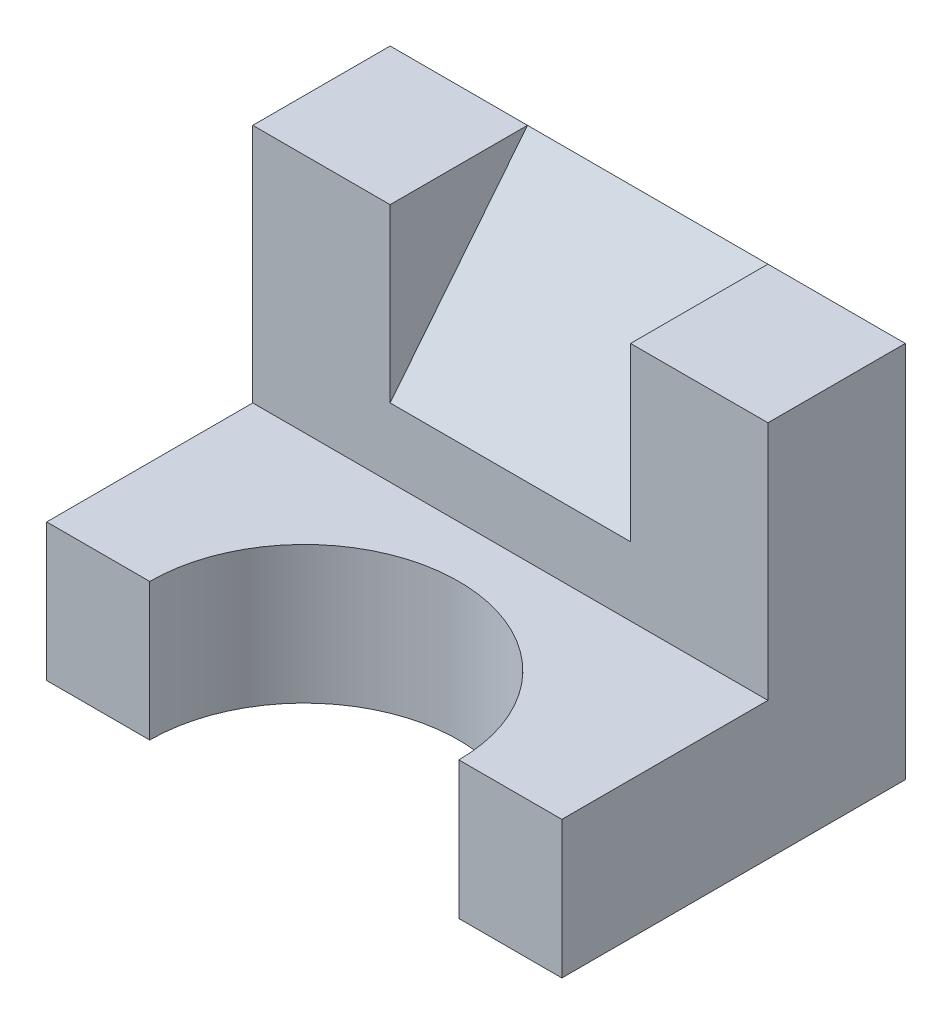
ISO-10303-21;
HEADER;
FILE_DESCRIPTION(('STEP AP214'),'2;1');
FILE_NAME('part.step','',(''),(''),'','','');
FILE_SCHEMA(('AUTOMOTIVE_DESIGN { 1 0 10303 214 1 1 1 1 }'));
ENDSEC;
DATA;
#1=APPLICATION_CONTEXT('core data for automotive mechanical design processes');
#2=APPLICATION_PROTOCOL_DEFINITION('international standard','automotive_design',2000,#1);
#3=PRODUCT_CONTEXT('',#1,'mechanical');
#4=PRODUCT('Part','Part','',(#3));
#5=PRODUCT_RELATED_PRODUCT_CATEGORY('part','',(#4));
#6=PRODUCT_DEFINITION_FORMATION('','',#4);
#7=PRODUCT_DEFINITION_CONTEXT('part definition',#1,'design');
#8=PRODUCT_DEFINITION('design','',#6,#7);
#9=PRODUCT_DEFINITION_SHAPE('','',#8);
#10=(LENGTH_UNIT() NAMED_UNIT(*) SI_UNIT(.MILLI.,.METRE.));
#11=(NAMED_UNIT(*) PLANE_ANGLE_UNIT() SI_UNIT($,.RADIAN.));
#12=(NAMED_UNIT(*) SI_UNIT($,.STERADIAN.) SOLID_ANGLE_UNIT());
#13=UNCERTAINTY_MEASURE_WITH_UNIT(LENGTH_MEASURE(1.E-05),#10,'distance_accuracy_value','');
#14=(GEOMETRIC_REPRESENTATION_CONTEXT(3) GLOBAL_UNCERTAINTY_ASSIGNED_CONTEXT((#13)) GLOBAL_UNIT_ASSIGNED_CONTEXT((#10,
#11,#12)) REPRESENTATION_CONTEXT('',''));
#15=CARTESIAN_POINT('',(0.,0.,0.));
#16=DIRECTION('',(0.,0.,1.));
#17=DIRECTION('',(1.,0.,0.));
#18=AXIS2_PLACEMENT_3D('',#15,#16,#17);
#19=CARTESIAN_POINT('',(0.,22.,-12.));
#20=DIRECTION('',(0.,1.,0.));
#21=DIRECTION('',(0.,0.,1.));
#22=AXIS2_PLACEMENT_3D('',#19,#20,#21);
#23=PLANE('',#22);
#24=DIRECTION('',(1.,0.,0.));
#25=VECTOR('',#24,1.);
#26=CARTESIAN_POINT('',(0.,22.,-12.));
#27=LINE('',#26,#25);
#28=CARTESIAN_POINT('',(0.,22.,-12.));
#29=VERTEX_POINT('',#28);
#30=CARTESIAN_POINT('',(8.,22.,-12.));
#31=VERTEX_POINT('',#30);
#32=EDGE_CURVE('E156',#29,#31,#27,.T.);
#33=ORIENTED_EDGE('',*,*,#32,.T.);
#34=DIRECTION('',(0.,0.,1.));
#35=VECTOR('',#34,1.);
#36=CARTESIAN_POINT('',(8.,22.,-12.));
#37=LINE('',#36,#35);
#38=CARTESIAN_POINT('',(8.,22.,-20.));
#39=VERTEX_POINT('',#38);
#40=EDGE_CURVE('E136',#39,#31,#37,.T.);
#41=ORIENTED_EDGE('',*,*,#40,.F.);
#42=DIRECTION('',(-1.,0.,0.));
#43=VECTOR('',#42,1.);
#44=CARTESIAN_POINT('',(0.,22.,-20.));
#45=LINE('',#44,#43);
#46=CARTESIAN_POINT('',(0.,22.,-20.));
#47=VERTEX_POINT('',#46);
#48=EDGE_CURVE('E162',#39,#47,#45,.T.);
#49=ORIENTED_EDGE('',*,*,#48,.T.);
#50=DIRECTION('',(0.,0.,1.));
#51=VECTOR('',#50,1.);
#52=CARTESIAN_POINT('',(0.,22.,-20.));
#53=LINE('',#52,#51);
#54=EDGE_CURVE('E153',#47,#29,#53,.T.);
#55=ORIENTED_EDGE('',*,*,#54,.T.);
#56=EDGE_LOOP('',(#33,#41,#49,#55));
#57=FACE_BOUND('',#56,.T.);
#58=ADVANCED_FACE('F31',(#57),#23,.T.);
#59=CARTESIAN_POINT('',(0.,8.,0.));
#60=DIRECTION('',(0.,0.,-1.));
#61=DIRECTION('',(-1.,0.,0.));
#62=AXIS2_PLACEMENT_3D('',#59,#60,#61);
#63=PLANE('',#62);
#64=DIRECTION('',(1.,0.,0.));
#65=VECTOR('',#64,1.);
#66=CARTESIAN_POINT('',(0.,0.,0.));
#67=LINE('',#66,#65);
#68=CARTESIAN_POINT('',(0.,0.,0.));
#69=VERTEX_POINT('',#68);
#70=CARTESIAN_POINT('',(6.,0.,0.));
#71=VERTEX_POINT('',#70);
#72=EDGE_CURVE('E192',#69,#71,#67,.T.);
#73=ORIENTED_EDGE('',*,*,#72,.T.);
#74=DIRECTION('',(0.,1.,0.));
#75=VECTOR('',#74,1.);
#76=CARTESIAN_POINT('',(6.,0.,0.));
#77=LINE('',#76,#75);
#78=CARTESIAN_POINT('',(6.,8.,0.));
#79=VERTEX_POINT('',#78);
#80=EDGE_CURVE('E56',#71,#79,#77,.T.);
#81=ORIENTED_EDGE('',*,*,#80,.T.);
#82=DIRECTION('',(1.,0.,0.));
#83=VECTOR('',#82,1.);
#84=CARTESIAN_POINT('',(0.,8.,0.));
#85=LINE('',#84,#83);
#86=CARTESIAN_POINT('',(0.,8.,0.));
#87=VERTEX_POINT('',#86);
#88=EDGE_CURVE('E213',#87,#79,#85,.T.);
#89=ORIENTED_EDGE('',*,*,#88,.F.);
#90=DIRECTION('',(0.,-1.,0.));
#91=VECTOR('',#90,1.);
#92=CARTESIAN_POINT('',(0.,8.,0.));
#93=LINE('',#92,#91);
#94=EDGE_CURVE('E11',#87,#69,#93,.T.);
#95=ORIENTED_EDGE('',*,*,#94,.T.);
#96=EDGE_LOOP('',(#73,#81,#89,#95));
#97=FACE_BOUND('',#96,.T.);
#98=ADVANCED_FACE('F243',(#97),#63,.F.);
#99=CARTESIAN_POINT('',(0.,8.,-20.));
#100=DIRECTION('',(0.,-1.,0.));
#101=DIRECTION('',(0.,0.,-1.));
#102=AXIS2_PLACEMENT_3D('',#99,#100,#101);
#103=PLANE('',#102);
#104=ORIENTED_EDGE('',*,*,#88,.T.);
#105=CARTESIAN_POINT('',(15.,8.,0.));
#106=DIRECTION('',(0.,1.,0.));
#107=DIRECTION('',(0.,0.,1.));
#108=AXIS2_PLACEMENT_3D('',#105,#106,#107);
#109=CIRCLE('',#108,9.);
#110=CARTESIAN_POINT('',(24.,8.,0.));
#111=VERTEX_POINT('',#110);
#112=EDGE_CURVE('E130',#111,#79,#109,.T.);
#113=ORIENTED_EDGE('',*,*,#112,.F.);
#114=CARTESIAN_POINT('',(30.,8.,0.));
#115=VERTEX_POINT('',#114);
#116=EDGE_CURVE('E208',#111,#115,#85,.T.);
#117=ORIENTED_EDGE('',*,*,#116,.T.);
#118=DIRECTION('',(0.,0.,-1.));
#119=VECTOR('',#118,1.);
#120=CARTESIAN_POINT('',(30.,8.,0.));
#121=LINE('',#120,#119);
#122=CARTESIAN_POINT('',(30.,8.,-12.));
#123=VERTEX_POINT('',#122);
#124=EDGE_CURVE('E175',#115,#123,#121,.T.);
#125=ORIENTED_EDGE('',*,*,#124,.T.);
#126=DIRECTION('',(1.,0.,0.));
#127=VECTOR('',#126,1.);
#128=CARTESIAN_POINT('',(0.,8.,-12.));
#129=LINE('',#128,#127);
#130=CARTESIAN_POINT('',(0.,8.,-12.));
#131=VERTEX_POINT('',#130);
#132=EDGE_CURVE('E152',#131,#123,#129,.T.);
#133=ORIENTED_EDGE('',*,*,#132,.F.);
#134=DIRECTION('',(0.,0.,1.));
#135=VECTOR('',#134,1.);
#136=CARTESIAN_POINT('',(0.,8.,0.));
#137=LINE('',#136,#135);
#138=EDGE_CURVE('E201',#131,#87,#137,.T.);
#139=ORIENTED_EDGE('',*,*,#138,.T.);
#140=EDGE_LOOP('',(#104,#113,#117,#125,#133,#139));
#141=FACE_BOUND('',#140,.T.);
#142=ADVANCED_FACE('F218',(#141),#103,.F.);
#143=CARTESIAN_POINT('',(0.,8.,0.));
#144=DIRECTION('',(1.,0.,0.));
#145=DIRECTION('',(0.,0.,-1.));
#146=AXIS2_PLACEMENT_3D('',#143,#144,#145);
#147=PLANE('',#146);
#148=DIRECTION('',(0.,0.,1.));
#149=VECTOR('',#148,1.);
#150=CARTESIAN_POINT('',(0.,0.,0.));
#151=LINE('',#150,#149);
#152=CARTESIAN_POINT('',(0.,0.,-20.));
#153=VERTEX_POINT('',#152);
#154=EDGE_CURVE('E183',#153,#69,#151,.T.);
#155=ORIENTED_EDGE('',*,*,#154,.T.);
#156=ORIENTED_EDGE('',*,*,#94,.F.);
#157=ORIENTED_EDGE('',*,*,#138,.F.);
#158=DIRECTION('',(0.,-1.,0.));
#159=VECTOR('',#158,1.);
#160=CARTESIAN_POINT('',(0.,22.,-12.));
#161=LINE('',#160,#159);
#162=EDGE_CURVE('E180',#29,#131,#161,.T.);
#163=ORIENTED_EDGE('',*,*,#162,.F.);
#164=ORIENTED_EDGE('',*,*,#54,.F.);
#165=DIRECTION('',(0.,-1.,0.));
#166=VECTOR('',#165,1.);
#167=CARTESIAN_POINT('',(0.,8.,-20.));
#168=LINE('',#167,#166);
#169=EDGE_CURVE('E202',#47,#153,#168,.T.);
#170=ORIENTED_EDGE('',*,*,#169,.T.);
#171=EDGE_LOOP('',(#155,#156,#157,#163,#164,#170));
#172=FACE_BOUND('',#171,.T.);
#173=ADVANCED_FACE('F33',(#172),#147,.F.);
#174=ORIENTED_EDGE('',*,*,#116,.F.);
#175=DIRECTION('',(0.,1.,0.));
#176=VECTOR('',#175,1.);
#177=CARTESIAN_POINT('',(24.,0.,0.));
#178=LINE('',#177,#176);
#179=CARTESIAN_POINT('',(24.,0.,0.));
#180=VERTEX_POINT('',#179);
#181=EDGE_CURVE('E147',#111,#180,#178,.F.);
#182=ORIENTED_EDGE('',*,*,#181,.T.);
#183=CARTESIAN_POINT('',(30.,0.,0.));
#184=VERTEX_POINT('',#183);
#185=EDGE_CURVE('E186',#180,#184,#67,.T.);
#186=ORIENTED_EDGE('',*,*,#185,.T.);
#187=DIRECTION('',(0.,-1.,0.));
#188=VECTOR('',#187,1.);
#189=CARTESIAN_POINT('',(30.,8.,0.));
#190=LINE('',#189,#188);
#191=EDGE_CURVE('E40',#115,#184,#190,.T.);
#192=ORIENTED_EDGE('',*,*,#191,.F.);
#193=EDGE_LOOP('',(#174,#182,#186,#192));
#194=FACE_BOUND('',#193,.T.);
#195=ADVANCED_FACE('F249',(#194),#63,.F.);
#196=CARTESIAN_POINT('',(30.,8.,0.));
#197=DIRECTION('',(-1.,0.,0.));
#198=DIRECTION('',(0.,0.,1.));
#199=AXIS2_PLACEMENT_3D('',#196,#197,#198);
#200=PLANE('',#199);
#201=DIRECTION('',(0.,0.,-1.));
#202=VECTOR('',#201,1.);
#203=CARTESIAN_POINT('',(30.,0.,0.));
#204=LINE('',#203,#202);
#205=CARTESIAN_POINT('',(30.,0.,-20.));
#206=VERTEX_POINT('',#205);
#207=EDGE_CURVE('E197',#184,#206,#204,.T.);
#208=ORIENTED_EDGE('',*,*,#207,.T.);
#209=DIRECTION('',(0.,-1.,0.));
#210=VECTOR('',#209,1.);
#211=CARTESIAN_POINT('',(30.,8.,-20.));
#212=LINE('',#211,#210);
#213=CARTESIAN_POINT('',(30.,22.,-20.));
#214=VERTEX_POINT('',#213);
#215=EDGE_CURVE('E204',#214,#206,#212,.T.);
#216=ORIENTED_EDGE('',*,*,#215,.F.);
#217=DIRECTION('',(0.,0.,-1.));
#218=VECTOR('',#217,1.);
#219=CARTESIAN_POINT('',(30.,22.,-20.));
#220=LINE('',#219,#218);
#221=CARTESIAN_POINT('',(30.,22.,-12.));
#222=VERTEX_POINT('',#221);
#223=EDGE_CURVE('E159',#222,#214,#220,.T.);
#224=ORIENTED_EDGE('',*,*,#223,.F.);
#225=DIRECTION('',(0.,-1.,0.));
#226=VECTOR('',#225,1.);
#227=CARTESIAN_POINT('',(30.,22.,-12.));
#228=LINE('',#227,#226);
#229=EDGE_CURVE('E166',#222,#123,#228,.T.);
#230=ORIENTED_EDGE('',*,*,#229,.T.);
#231=ORIENTED_EDGE('',*,*,#124,.F.);
#232=ORIENTED_EDGE('',*,*,#191,.T.);
#233=EDGE_LOOP('',(#208,#216,#224,#230,#231,#232));
#234=FACE_BOUND('',#233,.T.);
#235=ADVANCED_FACE('F221',(#234),#200,.F.);
#236=CARTESIAN_POINT('',(0.,8.,-20.));
#237=DIRECTION('',(0.,0.,1.));
#238=DIRECTION('',(1.,0.,0.));
#239=AXIS2_PLACEMENT_3D('',#236,#237,#238);
#240=PLANE('',#239);
#241=DIRECTION('',(-1.,0.,0.));
#242=VECTOR('',#241,1.);
#243=CARTESIAN_POINT('',(0.,0.,-20.));
#244=LINE('',#243,#242);
#245=EDGE_CURVE('E199',#206,#153,#244,.T.);
#246=ORIENTED_EDGE('',*,*,#245,.T.);
#247=ORIENTED_EDGE('',*,*,#169,.F.);
#248=ORIENTED_EDGE('',*,*,#48,.F.);
#249=DIRECTION('',(-1.,0.,0.));
#250=VECTOR('',#249,1.);
#251=CARTESIAN_POINT('',(22.,22.,-20.));
#252=LINE('',#251,#250);
#253=CARTESIAN_POINT('',(22.,22.,-20.));
#254=VERTEX_POINT('',#253);
#255=EDGE_CURVE('E48',#254,#39,#252,.T.);
#256=ORIENTED_EDGE('',*,*,#255,.F.);
#257=EDGE_CURVE('E163',#214,#254,#45,.T.);
#258=ORIENTED_EDGE('',*,*,#257,.F.);
#259=ORIENTED_EDGE('',*,*,#215,.T.);
#260=EDGE_LOOP('',(#246,#247,#248,#256,#258,#259));
#261=FACE_BOUND('',#260,.T.);
#262=ADVANCED_FACE('F226',(#261),#240,.F.);
#263=CARTESIAN_POINT('',(0.,0.,-20.));
#264=DIRECTION('',(0.,-1.,0.));
#265=DIRECTION('',(0.,0.,-1.));
#266=AXIS2_PLACEMENT_3D('',#263,#264,#265);
#267=PLANE('',#266);
#268=CARTESIAN_POINT('',(15.,0.,0.));
#269=DIRECTION('',(0.,1.,0.));
#270=DIRECTION('',(0.,0.,1.));
#271=AXIS2_PLACEMENT_3D('',#268,#269,#270);
#272=CIRCLE('',#271,9.);
#273=EDGE_CURVE('E145',#180,#71,#272,.T.);
#274=ORIENTED_EDGE('',*,*,#273,.T.);
#275=ORIENTED_EDGE('',*,*,#72,.F.);
#276=ORIENTED_EDGE('',*,*,#154,.F.);
#277=ORIENTED_EDGE('',*,*,#245,.F.);
#278=ORIENTED_EDGE('',*,*,#207,.F.);
#279=ORIENTED_EDGE('',*,*,#185,.F.);
#280=EDGE_LOOP('',(#274,#275,#276,#277,#278,#279));
#281=FACE_BOUND('',#280,.T.);
#282=ADVANCED_FACE('F258',(#281),#267,.T.);
#283=CARTESIAN_POINT('',(0.,22.,-12.));
#284=DIRECTION('',(0.,0.,-1.));
#285=DIRECTION('',(-1.,0.,0.));
#286=AXIS2_PLACEMENT_3D('',#283,#284,#285);
#287=PLANE('',#286);
#288=CARTESIAN_POINT('',(22.,22.,-12.));
#289=VERTEX_POINT('',#288);
#290=EDGE_CURVE('E135',#289,#222,#27,.T.);
#291=ORIENTED_EDGE('',*,*,#290,.F.);
#292=DIRECTION('',(0.,-1.,0.));
#293=VECTOR('',#292,1.);
#294=CARTESIAN_POINT('',(22.,22.,-12.));
#295=LINE('',#294,#293);
#296=CARTESIAN_POINT('',(22.,12.,-12.));
#297=VERTEX_POINT('',#296);
#298=EDGE_CURVE('E119',#289,#297,#295,.T.);
#299=ORIENTED_EDGE('',*,*,#298,.T.);
#300=DIRECTION('',(-1.,0.,0.));
#301=VECTOR('',#300,1.);
#302=CARTESIAN_POINT('',(22.,12.,-12.));
#303=LINE('',#302,#301);
#304=CARTESIAN_POINT('',(8.,12.,-12.));
#305=VERTEX_POINT('',#304);
#306=EDGE_CURVE('E124',#297,#305,#303,.T.);
#307=ORIENTED_EDGE('',*,*,#306,.T.);
#308=DIRECTION('',(0.,-1.,0.));
#309=VECTOR('',#308,1.);
#310=CARTESIAN_POINT('',(8.,22.,-12.));
#311=LINE('',#310,#309);
#312=EDGE_CURVE('E141',#31,#305,#311,.T.);
#313=ORIENTED_EDGE('',*,*,#312,.F.);
#314=ORIENTED_EDGE('',*,*,#32,.F.);
#315=ORIENTED_EDGE('',*,*,#162,.T.);
#316=ORIENTED_EDGE('',*,*,#132,.T.);
#317=ORIENTED_EDGE('',*,*,#229,.F.);
#318=EDGE_LOOP('',(#291,#299,#307,#313,#314,#315,#316,#317));
#319=FACE_BOUND('',#318,.T.);
#320=ADVANCED_FACE('F133',(#319),#287,.F.);
#321=DIRECTION('',(0.,0.,1.));
#322=VECTOR('',#321,1.);
#323=CARTESIAN_POINT('',(22.,22.,-12.));
#324=LINE('',#323,#322);
#325=EDGE_CURVE('E121',#254,#289,#324,.T.);
#326=ORIENTED_EDGE('',*,*,#325,.T.);
#327=ORIENTED_EDGE('',*,*,#290,.T.);
#328=ORIENTED_EDGE('',*,*,#223,.T.);
#329=ORIENTED_EDGE('',*,*,#257,.T.);
#330=EDGE_LOOP('',(#326,#327,#328,#329));
#331=FACE_BOUND('',#330,.T.);
#332=ADVANCED_FACE('F224',(#331),#23,.T.);
#333=CARTESIAN_POINT('',(15.,0.,0.));
#334=DIRECTION('',(0.,1.,0.));
#335=DIRECTION('',(0.,0.,1.));
#336=AXIS2_PLACEMENT_3D('',#333,#334,#335);
#337=CYLINDRICAL_SURFACE('',#336,9.);
#338=ORIENTED_EDGE('',*,*,#273,.F.);
#339=ORIENTED_EDGE('',*,*,#181,.F.);
#340=ORIENTED_EDGE('',*,*,#112,.T.);
#341=ORIENTED_EDGE('',*,*,#80,.F.);
#342=EDGE_LOOP('',(#338,#339,#340,#341));
#343=FACE_BOUND('',#342,.T.);
#344=ADVANCED_FACE('F253',(#343),#337,.F.);
#345=CARTESIAN_POINT('',(22.,12.,-12.));
#346=DIRECTION('',(0.,0.624695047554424,0.78086880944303));
#347=DIRECTION('',(0.,-0.78086880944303,0.624695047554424));
#348=AXIS2_PLACEMENT_3D('',#345,#346,#347);
#349=PLANE('',#348);
#350=DIRECTION('',(0.,0.78086880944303,-0.624695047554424));
#351=VECTOR('',#350,1.);
#352=CARTESIAN_POINT('',(8.,12.,-12.));
#353=LINE('',#352,#351);
#354=EDGE_CURVE('E126',#305,#39,#353,.T.);
#355=ORIENTED_EDGE('',*,*,#354,.F.);
#356=ORIENTED_EDGE('',*,*,#306,.F.);
#357=DIRECTION('',(0.,0.78086880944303,-0.624695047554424));
#358=VECTOR('',#357,1.);
#359=CARTESIAN_POINT('',(22.,12.,-12.));
#360=LINE('',#359,#358);
#361=EDGE_CURVE('E115',#297,#254,#360,.T.);
#362=ORIENTED_EDGE('',*,*,#361,.T.);
#363=ORIENTED_EDGE('',*,*,#255,.T.);
#364=EDGE_LOOP('',(#355,#356,#362,#363));
#365=FACE_BOUND('',#364,.T.);
#366=ADVANCED_FACE('F125',(#365),#349,.T.);
#367=CARTESIAN_POINT('',(22.,22.,-12.));
#368=DIRECTION('',(1.,0.,0.));
#369=DIRECTION('',(0.,0.,-1.));
#370=AXIS2_PLACEMENT_3D('',#367,#368,#369);
#371=PLANE('',#370);
#372=ORIENTED_EDGE('',*,*,#298,.F.);
#373=ORIENTED_EDGE('',*,*,#325,.F.);
#374=ORIENTED_EDGE('',*,*,#361,.F.);
#375=EDGE_LOOP('',(#372,#373,#374));
#376=FACE_BOUND('',#375,.T.);
#377=ADVANCED_FACE('F117',(#376),#371,.F.);
#378=CARTESIAN_POINT('',(8.,22.,-12.));
#379=DIRECTION('',(1.,0.,0.));
#380=DIRECTION('',(0.,0.,-1.));
#381=AXIS2_PLACEMENT_3D('',#378,#379,#380);
#382=PLANE('',#381);
#383=ORIENTED_EDGE('',*,*,#312,.T.);
#384=ORIENTED_EDGE('',*,*,#354,.T.);
#385=ORIENTED_EDGE('',*,*,#40,.T.);
#386=EDGE_LOOP('',(#383,#384,#385));
#387=FACE_BOUND('',#386,.T.);
#388=ADVANCED_FACE('F234',(#387),#382,.T.);
#389=CLOSED_SHELL('',(#58,#98,#142,#173,#195,#235,#262,#282,#320,#332,#344,#366,#377,#388));
#390=MANIFOLD_SOLID_BREP('B2',#389);
#391=ADVANCED_BREP_SHAPE_REPRESENTATION('',(#18,#390),#14);
#392=SHAPE_DEFINITION_REPRESENTATION(#9,#391);
ENDSEC;
END-ISO-10303-21;
